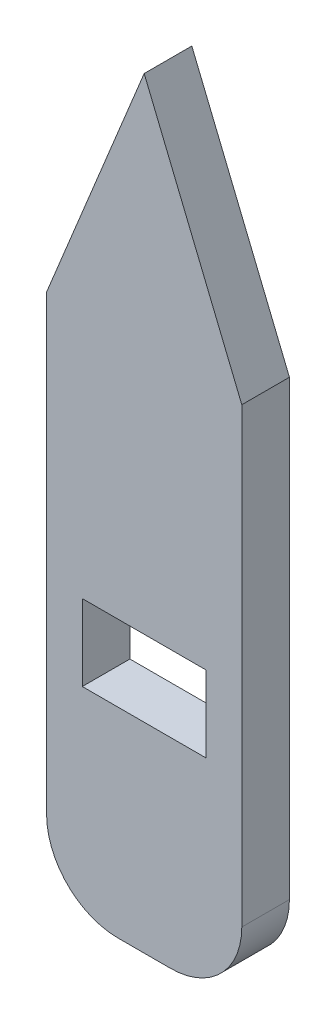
from build123d import *

# Parameters (mm, degrees)
ESQUISSE1_W        = 5.2
ESQUISSE1_H        = 3.2
BOSS_EXTRU_1_DEPTH = 2


with BuildPart() as part:
    # Esquisse1 → Boss.-Extru.1 (new body)
    with BuildSketch(Plane.XY):
        with BuildLine():
            Line((-4.1, 12), (-4.1, -7))
            ThreePointArc((-4.1, -7), (-3.221320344, -9.121320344), (-1.1, -10))
            Line((-1.1, -10), (1.1, -10))
            ThreePointArc((1.1, -10), (3.221320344, -9.121320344), (4.1, -7))
            Line((4.1, -7), (4.1, 12))
            Line((4.1, 12), (0, 22))
            Line((0, 22), (-4.1, 12))
        make_face()
        Rectangle(ESQUISSE1_W, ESQUISSE1_H, mode=Mode.SUBTRACT)
    extrude(amount=BOSS_EXTRU_1_DEPTH)


solid = part.part
